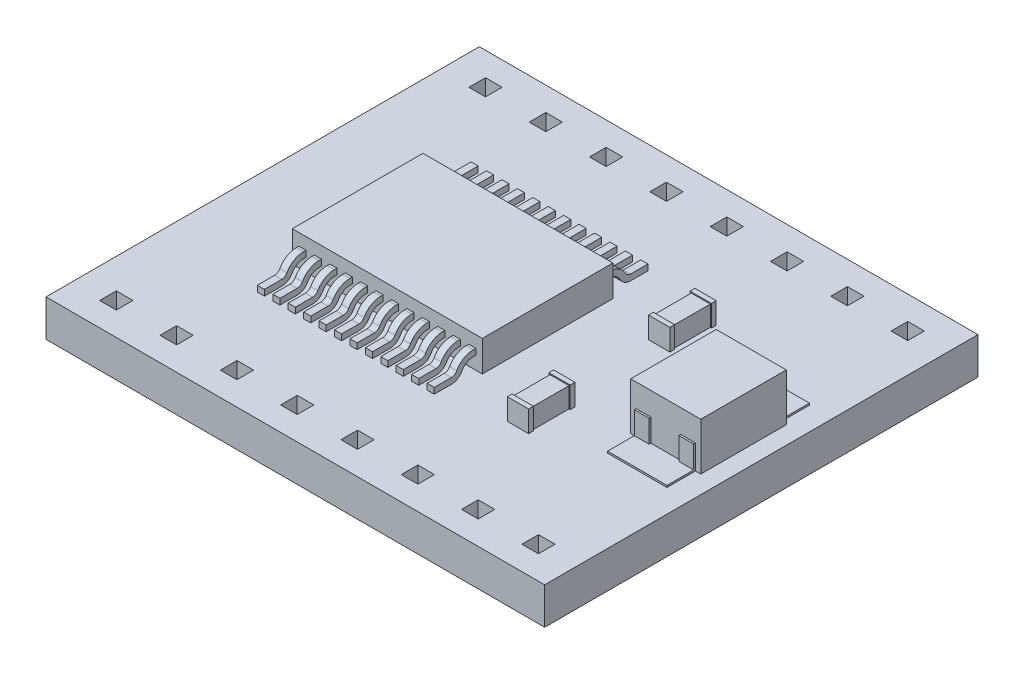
from build123d import *

# Parameters (mm, degrees)
SKETCH_1_W           = 21
SKETCH_1_H           = 18.25
EXTRUDE_1_DEPTH      = 1.55
SKETCH_2_W           = 0.7
SKETCH_2_H           = 0.7
CUT_EXTRUDE_1_DEPTH  = 14.997075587
SKETCH_3_W           = 8
SKETCH_3_H           = 5.5
EXTRUDE_2_DEPTH      = 1.3
SKETCH_4_W           = 0.3
SKETCH_4_H           = 1.75
EXTRUDE_4_DEPTH      = 0.8
CUT_EXTRUDE_2_DEPTH  = 20.503541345
SKETCH_6_W           = 2.95
SKETCH_6_H           = 3.6
EXTRUDE_5_DEPTH      = 2
SKETCH_7_W           = 2.5
SKETCH_7_H           = 1.2
EXTRUDE_6_DEPTH      = 0.075
SKETCH_8_W           = 0.625
SKETCH_8_H           = 0.95
EXTRUDE_7_DEPTH      = 0.075
SKETCH_9_W           = 0.8
SKETCH_9_H           = 1.75
EXTRUDE_8_DEPTH      = 0.85
EXTRUDE_9_DEPTH      = 0.05
EXTRUDE_9_DEPTH_BACK = 2.4
SKETCH_10_W          = 0.9
SKETCH_10_H          = 0.2


with BuildPart() as part:
    # Sketch 1 → Extrude 1 (new body)
    with BuildSketch(Plane(origin=(0, 0, 0), x_dir=(1, 0, 0), z_dir=(0, 1, 0))):
        Rectangle(SKETCH_1_W, SKETCH_1_H)
    extrude(amount=EXTRUDE_1_DEPTH)

    # Sketch 2 → Cut-Extrude 1 (cut, through all)
    with BuildSketch(Plane(origin=(0, 1.55, 0), x_dir=(1, 0, 0), z_dir=(0, 1, 0))):
        with Locations((3.81, 7.775)):
            Rectangle(SKETCH_2_W, SKETCH_2_H)
        with Locations((1.27, 7.775)):
            Rectangle(SKETCH_2_W, SKETCH_2_H)
        with Locations((-1.27, 7.775)):
            Rectangle(SKETCH_2_W, SKETCH_2_H)
        with Locations((6.35, 7.775)):
            Rectangle(SKETCH_2_W, SKETCH_2_H)
        with Locations((8.89, 7.775)):
            Rectangle(SKETCH_2_W, SKETCH_2_H)
        with Locations((-8.89, 7.775)):
            Rectangle(SKETCH_2_W, SKETCH_2_H)
        with Locations((-6.35, 7.775)):
            Rectangle(SKETCH_2_W, SKETCH_2_H)
        with Locations((-3.81, 7.775)):
            Rectangle(SKETCH_2_W, SKETCH_2_H)
        with Locations((-3.81, -7.775)):
            Rectangle(SKETCH_2_W, SKETCH_2_H)
        with Locations((-6.35, -7.775)):
            Rectangle(SKETCH_2_W, SKETCH_2_H)
        with Locations((-8.89, -7.775)):
            Rectangle(SKETCH_2_W, SKETCH_2_H)
        with Locations((8.89, -7.775)):
            Rectangle(SKETCH_2_W, SKETCH_2_H)
        with Locations((6.35, -7.775)):
            Rectangle(SKETCH_2_W, SKETCH_2_H)
        with Locations((3.81, -7.775)):
            Rectangle(SKETCH_2_W, SKETCH_2_H)
        with Locations((-1.27, -7.775)):
            Rectangle(SKETCH_2_W, SKETCH_2_H)
        with Locations((1.27, -7.775)):
            Rectangle(SKETCH_2_W, SKETCH_2_H)
    extrude(amount=-CUT_EXTRUDE_1_DEPTH, mode=Mode.SUBTRACT)

    # Sketch 3 → Extrude 2 (add)
    with BuildSketch(Plane(origin=(0, 1.55, 0), x_dir=(1, 0, 0), z_dir=(0, 1, 0))):
        with Locations((-2.5, 0)):
            Rectangle(SKETCH_3_W, SKETCH_3_H)
    extrude(amount=EXTRUDE_2_DEPTH)

    # Sketch 4 → Extrude 4 (add)
    with BuildSketch(Plane(origin=(0, 1.55, 0), x_dir=(1, 0, 0), z_dir=(0, 1, 0))):
        with Locations((-2.175, -3.625)):
            Rectangle(SKETCH_4_W, SKETCH_4_H)
        with Locations((-2.175, 3.625)):
            Rectangle(SKETCH_4_W, SKETCH_4_H)
        with Locations((-1.525, -3.625)):
            Rectangle(SKETCH_4_W, SKETCH_4_H)
        with Locations((-1.525, 3.625)):
            Rectangle(SKETCH_4_W, SKETCH_4_H)
        with Locations((-0.875, -3.625)):
            Rectangle(SKETCH_4_W, SKETCH_4_H)
        with Locations((-0.875, 3.625)):
            Rectangle(SKETCH_4_W, SKETCH_4_H)
        with Locations((-0.225, -3.625)):
            Rectangle(SKETCH_4_W, SKETCH_4_H)
        with Locations((-0.225, 3.625)):
            Rectangle(SKETCH_4_W, SKETCH_4_H)
        with Locations((0.425, -3.625)):
            Rectangle(SKETCH_4_W, SKETCH_4_H)
        with Locations((0.425, 3.625)):
            Rectangle(SKETCH_4_W, SKETCH_4_H)
        with Locations((1.075, -3.625)):
            Rectangle(SKETCH_4_W, SKETCH_4_H)
        with Locations((1.075, 3.625)):
            Rectangle(SKETCH_4_W, SKETCH_4_H)
        with Locations((-6.075, 3.625)):
            Rectangle(SKETCH_4_W, SKETCH_4_H)
        with Locations((-6.075, -3.625)):
            Rectangle(SKETCH_4_W, SKETCH_4_H)
        with Locations((-5.425, 3.625)):
            Rectangle(SKETCH_4_W, SKETCH_4_H)
        with Locations((-5.425, -3.625)):
            Rectangle(SKETCH_4_W, SKETCH_4_H)
        with Locations((-4.775, 3.625)):
            Rectangle(SKETCH_4_W, SKETCH_4_H)
        with Locations((-4.775, -3.625)):
            Rectangle(SKETCH_4_W, SKETCH_4_H)
        with Locations((-4.125, 3.625)):
            Rectangle(SKETCH_4_W, SKETCH_4_H)
        with Locations((-4.125, -3.625)):
            Rectangle(SKETCH_4_W, SKETCH_4_H)
        with Locations((-3.475, 3.625)):
            Rectangle(SKETCH_4_W, SKETCH_4_H)
        with Locations((-3.475, -3.625)):
            Rectangle(SKETCH_4_W, SKETCH_4_H)
        with Locations((-2.825, 3.625)):
            Rectangle(SKETCH_4_W, SKETCH_4_H)
        with Locations((-2.825, -3.625)):
            Rectangle(SKETCH_4_W, SKETCH_4_H)
    extrude(amount=EXTRUDE_4_DEPTH)

    # Sketch 5 → Cut-Extrude 2 (cut, through all)
    with BuildSketch(Plane.ZY.offset(6.5)):
        with BuildLine():
            Line((-3.773309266, 1.55), (-2.75, 1.55))
            Line((-2.75, 1.55), (-2.75, 2.1))
            Line((-2.75, 2.1), (-2.85, 2.1))
            ThreePointArc((-2.85, 2.1), (-3.131471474, 2.022518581), (-3.333638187, 1.811904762))
            ThreePointArc((-3.333638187, 1.811904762), (-3.517426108, 1.620437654), (-3.773309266, 1.55))
        make_face()
        with BuildLine():
            Line((-4.5, 1.8), (-3.773309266, 1.8))
            ThreePointArc((-3.773309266, 1.8), (-3.645367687, 1.835218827), (-3.553473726, 1.930952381))
            ThreePointArc((-3.553473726, 1.930952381), (-3.259413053, 2.237299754), (-2.85, 2.35))
            Line((-2.85, 2.35), (-4.5, 2.35))
            Line((-4.5, 2.35), (-4.5, 1.8))
        make_face()
        with BuildLine():
            Line((2.75, 2.1), (2.75, 1.55))
            Line((2.75, 1.55), (3.773309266, 1.55))
            ThreePointArc((3.773309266, 1.55), (3.517426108, 1.620437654), (3.333638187, 1.811904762))
            ThreePointArc((3.333638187, 1.811904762), (3.131471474, 2.022518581), (2.85, 2.1))
            Line((2.85, 2.1), (2.75, 2.1))
        make_face()
        with BuildLine():
            ThreePointArc((3.773309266, 1.8), (3.645367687, 1.835218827), (3.553473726, 1.930952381))
            ThreePointArc((3.553473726, 1.930952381), (3.259413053, 2.237299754), (2.85, 2.35))
            Line((2.85, 2.35), (4.5, 2.35))
            Line((4.5, 2.35), (4.5, 1.8))
            Line((4.5, 1.8), (3.773309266, 1.8))
        make_face()
    extrude(amount=-CUT_EXTRUDE_2_DEPTH, mode=Mode.SUBTRACT)

    # Sketch 6 → Extrude 5 (add)
    with BuildSketch(Plane(origin=(0, 1.55, 0), x_dir=(1, 0, 0), z_dir=(0, 1, 0))):
        with Locations((8.275, 0)):
            Rectangle(SKETCH_6_W, SKETCH_6_H)
    extrude(amount=EXTRUDE_5_DEPTH)

    # Sketch 7 → Extrude 6 (add)
    with BuildSketch(Plane(origin=(0, 1.55, 0), x_dir=(1, 0, 0), z_dir=(0, 1, 0))):
        with Locations((8.275, 2.4)):
            Rectangle(SKETCH_7_W, SKETCH_7_H)
        with Locations((8.275, -2.4)):
            Rectangle(SKETCH_7_W, SKETCH_7_H)
    extrude(amount=EXTRUDE_6_DEPTH)

    # Sketch 8 → Extrude 7 (add)
    with BuildSketch(Plane(origin=(0, 0, -1.8), x_dir=(-1, 0, 0), z_dir=(0, 0, -1))):
        with Locations((-9.2125, 2.1)):
            Rectangle(SKETCH_8_W, SKETCH_8_H)
        with Locations((-7.3375, 2.1)):
            Rectangle(SKETCH_8_W, SKETCH_8_H)
    extrude_7 = extrude(amount=EXTRUDE_7_DEPTH)

    # Mirror 1: Extrude 7 across plane
    add(extrude_7.mirror(Plane.XY))

    # Sketch 9 → Extrude 8 (add)
    with BuildSketch(Plane(origin=(0, 1.55, 0), x_dir=(1, 0, 0), z_dir=(0, 1, 0))):
        with Locations((4.2, 2.975)):
            Rectangle(SKETCH_9_W, SKETCH_9_H)
        with Locations((4.2, -2.975)):
            Rectangle(SKETCH_9_W, SKETCH_9_H)
    extrude(amount=EXTRUDE_8_DEPTH)

    # Sketch 10 → Extrude 9 (add, two sides: drawn at the far end of the back side and taken through both)
    with BuildSketch(Plane(origin=(0, 2.4, 0), x_dir=(1, 0, 0), z_dir=(0, 1, 0)).offset(-EXTRUDE_9_DEPTH_BACK)):
        with Locations((4.2, -2.1)):
            Rectangle(SKETCH_10_W, SKETCH_10_H)
        with Locations((4.2, -3.85)):
            Rectangle(SKETCH_10_W, SKETCH_10_H)
        with Locations((4.2, 3.85)):
            Rectangle(SKETCH_10_W, SKETCH_10_H)
        with Locations((4.2, 2.1)):
            Rectangle(SKETCH_10_W, SKETCH_10_H)
    extrude(amount=EXTRUDE_9_DEPTH + EXTRUDE_9_DEPTH_BACK)


solid = part.part
